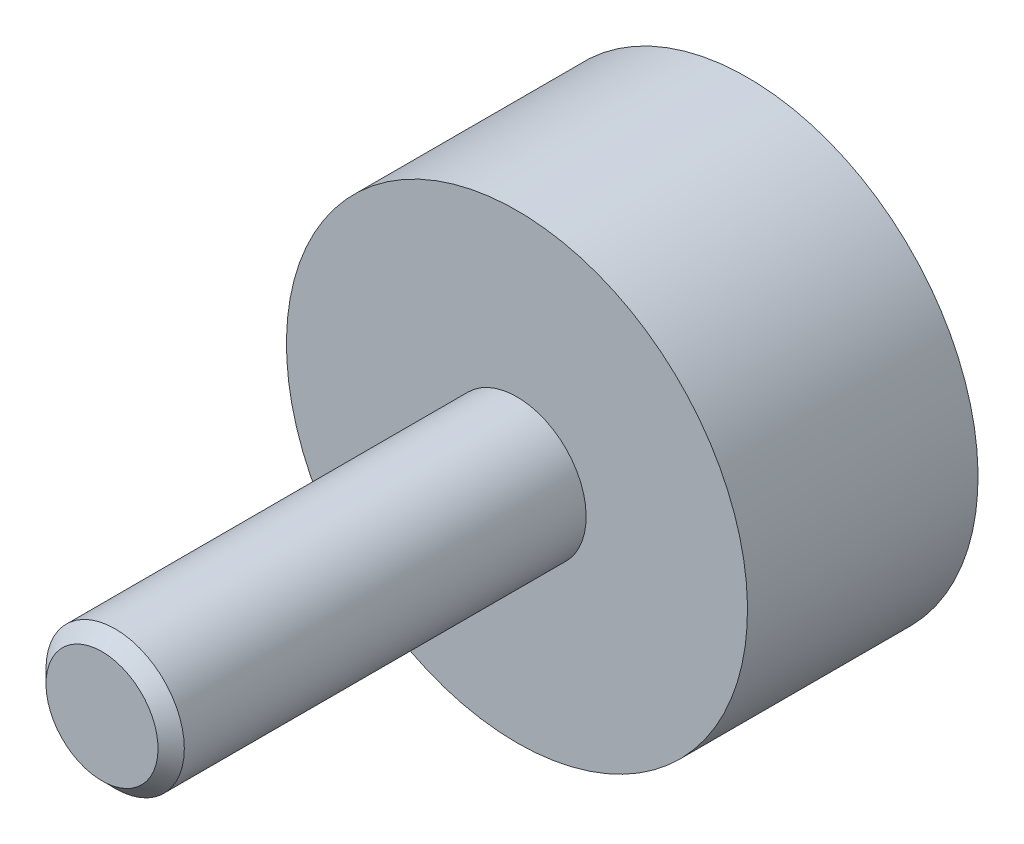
ISO-10303-21;
HEADER;
FILE_DESCRIPTION(('STEP AP214'),'2;1');
FILE_NAME('part.step','',(''),(''),'','','');
FILE_SCHEMA(('AUTOMOTIVE_DESIGN { 1 0 10303 214 1 1 1 1 }'));
ENDSEC;
DATA;
#1=APPLICATION_CONTEXT('core data for automotive mechanical design processes');
#2=APPLICATION_PROTOCOL_DEFINITION('international standard','automotive_design',2000,#1);
#3=PRODUCT_CONTEXT('',#1,'mechanical');
#4=PRODUCT('Part','Part','',(#3));
#5=PRODUCT_RELATED_PRODUCT_CATEGORY('part','',(#4));
#6=PRODUCT_DEFINITION_FORMATION('','',#4);
#7=PRODUCT_DEFINITION_CONTEXT('part definition',#1,'design');
#8=PRODUCT_DEFINITION('design','',#6,#7);
#9=PRODUCT_DEFINITION_SHAPE('','',#8);
#10=(LENGTH_UNIT() NAMED_UNIT(*) SI_UNIT(.MILLI.,.METRE.));
#11=(NAMED_UNIT(*) PLANE_ANGLE_UNIT() SI_UNIT($,.RADIAN.));
#12=(NAMED_UNIT(*) SI_UNIT($,.STERADIAN.) SOLID_ANGLE_UNIT());
#13=UNCERTAINTY_MEASURE_WITH_UNIT(LENGTH_MEASURE(1.E-05),#10,'distance_accuracy_value','');
#14=(GEOMETRIC_REPRESENTATION_CONTEXT(3) GLOBAL_UNCERTAINTY_ASSIGNED_CONTEXT((#13)) GLOBAL_UNIT_ASSIGNED_CONTEXT((#10,
#11,#12)) REPRESENTATION_CONTEXT('',''));
#15=CARTESIAN_POINT('',(0.,0.,0.));
#16=DIRECTION('',(0.,0.,1.));
#17=DIRECTION('',(1.,0.,0.));
#18=AXIS2_PLACEMENT_3D('',#15,#16,#17);
#19=CARTESIAN_POINT('',(9.3333333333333,0.,10.));
#20=DIRECTION('',(0.,0.,1.));
#21=DIRECTION('',(0.,-1.,0.));
#22=AXIS2_PLACEMENT_3D('',#19,#20,#21);
#23=PLANE('',#22);
#24=CARTESIAN_POINT('',(0.,0.,10.));
#25=DIRECTION('',(0.,0.,1.));
#26=DIRECTION('',(0.,-1.,0.));
#27=AXIS2_PLACEMENT_3D('',#24,#25,#26);
#28=CIRCLE('',#27,3.);
#29=CARTESIAN_POINT('',(0.,-3.,10.));
#30=VERTEX_POINT('',#29);
#31=EDGE_CURVE('E8',#30,#30,#28,.T.);
#32=ORIENTED_EDGE('',*,*,#31,.F.);
#33=EDGE_LOOP('',(#32));
#34=FACE_BOUND('',#33,.T.);
#35=CARTESIAN_POINT('',(0.,0.,10.));
#36=DIRECTION('',(0.,0.,1.));
#37=DIRECTION('',(0.,-1.,0.));
#38=AXIS2_PLACEMENT_3D('',#35,#36,#37);
#39=CIRCLE('',#38,10.);
#40=CARTESIAN_POINT('',(0.,-10.,10.));
#41=VERTEX_POINT('',#40);
#42=EDGE_CURVE('E18',#41,#41,#39,.T.);
#43=ORIENTED_EDGE('',*,*,#42,.T.);
#44=EDGE_LOOP('',(#43));
#45=FACE_BOUND('',#44,.T.);
#46=ADVANCED_FACE('F12',(#34,#45),#23,.T.);
#47=CARTESIAN_POINT('',(0.,0.,0.));
#48=DIRECTION('',(0.,0.,1.));
#49=DIRECTION('',(0.,-1.,0.));
#50=AXIS2_PLACEMENT_3D('',#47,#48,#49);
#51=CYLINDRICAL_SURFACE('',#50,10.);
#52=CARTESIAN_POINT('',(0.,0.,0.));
#53=DIRECTION('',(0.,0.,1.));
#54=DIRECTION('',(0.,-1.,0.));
#55=AXIS2_PLACEMENT_3D('',#52,#53,#54);
#56=CIRCLE('',#55,10.);
#57=CARTESIAN_POINT('',(0.,-10.,0.));
#58=VERTEX_POINT('',#57);
#59=EDGE_CURVE('E22',#58,#58,#56,.T.);
#60=ORIENTED_EDGE('',*,*,#59,.T.);
#61=EDGE_LOOP('',(#60));
#62=FACE_BOUND('',#61,.T.);
#63=ORIENTED_EDGE('',*,*,#42,.F.);
#64=EDGE_LOOP('',(#63));
#65=FACE_BOUND('',#64,.T.);
#66=ADVANCED_FACE('F50',(#62,#65),#51,.T.);
#67=CARTESIAN_POINT('',(10.,0.,0.));
#68=DIRECTION('',(0.,0.,-1.));
#69=DIRECTION('',(0.,1.,0.));
#70=AXIS2_PLACEMENT_3D('',#67,#68,#69);
#71=PLANE('',#70);
#72=ORIENTED_EDGE('',*,*,#59,.F.);
#73=EDGE_LOOP('',(#72));
#74=FACE_BOUND('',#73,.T.);
#75=ADVANCED_FACE('F55',(#74),#71,.T.);
#76=CARTESIAN_POINT('',(0.,0.,10.));
#77=DIRECTION('',(0.,0.,1.));
#78=DIRECTION('',(0.,-1.,0.));
#79=AXIS2_PLACEMENT_3D('',#76,#77,#78);
#80=CYLINDRICAL_SURFACE('',#79,3.);
#81=ORIENTED_EDGE('',*,*,#31,.T.);
#82=EDGE_LOOP('',(#81));
#83=FACE_BOUND('',#82,.T.);
#84=CARTESIAN_POINT('',(0.,0.,27.4293600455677));
#85=DIRECTION('',(0.,0.,-1.));
#86=DIRECTION('',(0.,1.,0.));
#87=AXIS2_PLACEMENT_3D('',#84,#85,#86);
#88=CIRCLE('',#87,3.);
#89=CARTESIAN_POINT('',(0.,3.,27.4293600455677));
#90=VERTEX_POINT('',#89);
#91=EDGE_CURVE('E26',#90,#90,#88,.T.);
#92=ORIENTED_EDGE('',*,*,#91,.T.);
#93=EDGE_LOOP('',(#92));
#94=FACE_BOUND('',#93,.T.);
#95=ADVANCED_FACE('F45',(#83,#94),#80,.T.);
#96=CARTESIAN_POINT('',(0.,0.,27.4293600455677));
#97=DIRECTION('',(0.,0.,-1.));
#98=DIRECTION('',(0.,1.,0.));
#99=AXIS2_PLACEMENT_3D('',#96,#97,#98);
#100=CONICAL_SURFACE('',#99,3.,0.785398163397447);
#101=CARTESIAN_POINT('',(0.,0.,28.));
#102=DIRECTION('',(0.,0.,-1.));
#103=DIRECTION('',(0.,1.,0.));
#104=AXIS2_PLACEMENT_3D('',#101,#102,#103);
#105=CIRCLE('',#104,2.42936004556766);
#106=CARTESIAN_POINT('',(0.,2.42936004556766,28.));
#107=VERTEX_POINT('',#106);
#108=EDGE_CURVE('E31',#107,#107,#105,.T.);
#109=ORIENTED_EDGE('',*,*,#108,.T.);
#110=EDGE_LOOP('',(#109));
#111=FACE_BOUND('',#110,.T.);
#112=ORIENTED_EDGE('',*,*,#91,.F.);
#113=EDGE_LOOP('',(#112));
#114=FACE_BOUND('',#113,.T.);
#115=ADVANCED_FACE('F35',(#111,#114),#100,.T.);
#116=CARTESIAN_POINT('',(0.,0.,28.));
#117=DIRECTION('',(0.,0.,1.));
#118=DIRECTION('',(0.,-1.,0.));
#119=AXIS2_PLACEMENT_3D('',#116,#117,#118);
#120=PLANE('',#119);
#121=ORIENTED_EDGE('',*,*,#108,.F.);
#122=EDGE_LOOP('',(#121));
#123=FACE_BOUND('',#122,.T.);
#124=ADVANCED_FACE('F38',(#123),#120,.T.);
#125=CLOSED_SHELL('',(#46,#66,#75,#95,#115,#124));
#126=MANIFOLD_SOLID_BREP('B1',#125);
#127=ADVANCED_BREP_SHAPE_REPRESENTATION('',(#18,#126),#14);
#128=SHAPE_DEFINITION_REPRESENTATION(#9,#127);
ENDSEC;
END-ISO-10303-21;
